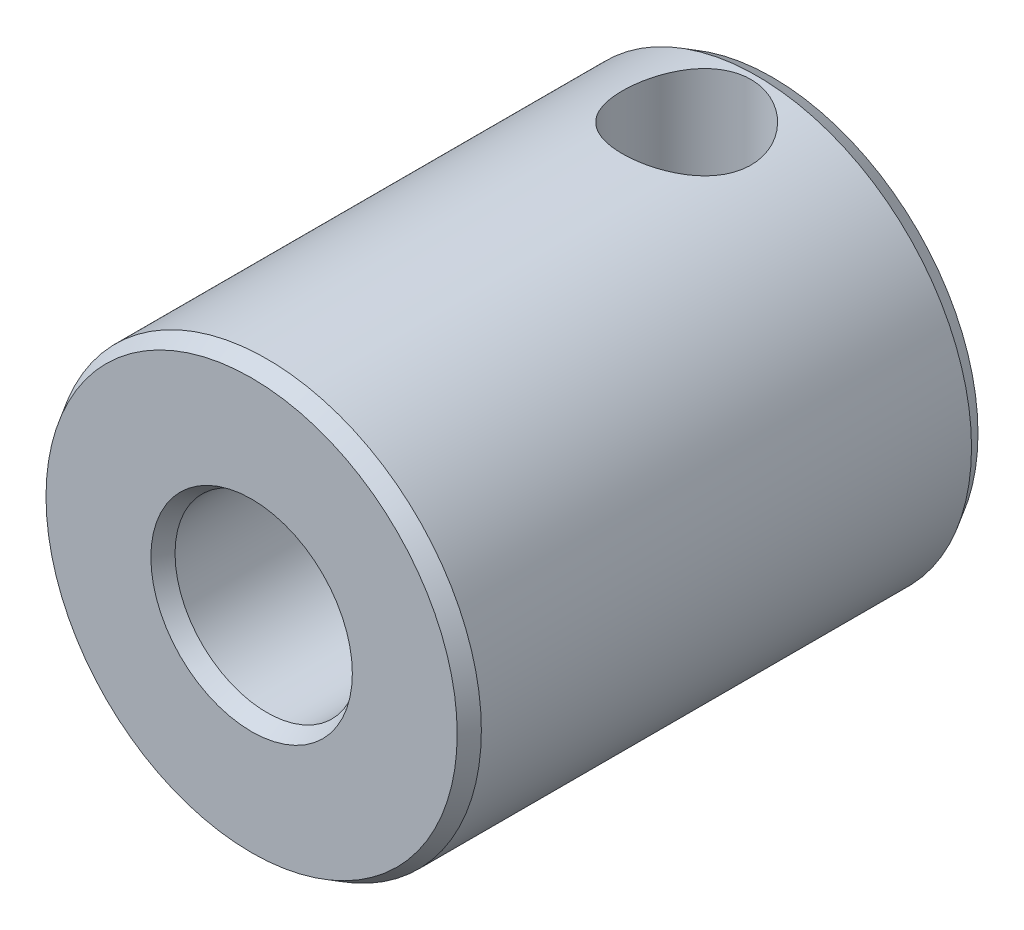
ISO-10303-21;
HEADER;
FILE_DESCRIPTION(('STEP AP214'),'2;1');
FILE_NAME('part.step','',(''),(''),'','','');
FILE_SCHEMA(('AUTOMOTIVE_DESIGN { 1 0 10303 214 1 1 1 1 }'));
ENDSEC;
DATA;
#1=APPLICATION_CONTEXT('core data for automotive mechanical design processes');
#2=APPLICATION_PROTOCOL_DEFINITION('international standard','automotive_design',2000,#1);
#3=PRODUCT_CONTEXT('',#1,'mechanical');
#4=PRODUCT('Part','Part','',(#3));
#5=PRODUCT_RELATED_PRODUCT_CATEGORY('part','',(#4));
#6=PRODUCT_DEFINITION_FORMATION('','',#4);
#7=PRODUCT_DEFINITION_CONTEXT('part definition',#1,'design');
#8=PRODUCT_DEFINITION('design','',#6,#7);
#9=PRODUCT_DEFINITION_SHAPE('','',#8);
#10=(LENGTH_UNIT() NAMED_UNIT(*) SI_UNIT(.MILLI.,.METRE.));
#11=(NAMED_UNIT(*) PLANE_ANGLE_UNIT() SI_UNIT($,.RADIAN.));
#12=(NAMED_UNIT(*) SI_UNIT($,.STERADIAN.) SOLID_ANGLE_UNIT());
#13=UNCERTAINTY_MEASURE_WITH_UNIT(LENGTH_MEASURE(1.E-05),#10,'distance_accuracy_value','');
#14=(GEOMETRIC_REPRESENTATION_CONTEXT(3) GLOBAL_UNCERTAINTY_ASSIGNED_CONTEXT((#13)) GLOBAL_UNIT_ASSIGNED_CONTEXT((#10,
#11,#12)) REPRESENTATION_CONTEXT('',''));
#15=CARTESIAN_POINT('',(0.,0.,0.));
#16=DIRECTION('',(0.,0.,1.));
#17=DIRECTION('',(1.,0.,0.));
#18=AXIS2_PLACEMENT_3D('',#15,#16,#17);
#19=CARTESIAN_POINT('',(0.,0.,20.4376167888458));
#20=DIRECTION('',(0.,0.,1.));
#21=DIRECTION('',(1.,0.,0.));
#22=AXIS2_PLACEMENT_3D('',#19,#20,#21);
#23=CYLINDRICAL_SURFACE('',#22,7.);
#24=CARTESIAN_POINT('',(0.,0.,0.5));
#25=DIRECTION('',(0.,0.,1.));
#26=DIRECTION('',(1.,0.,0.));
#27=AXIS2_PLACEMENT_3D('',#24,#25,#26);
#28=CIRCLE('',#27,7.);
#29=CARTESIAN_POINT('',(7.,0.,0.5));
#30=VERTEX_POINT('',#29);
#31=EDGE_CURVE('E25',#30,#30,#28,.T.);
#32=ORIENTED_EDGE('',*,*,#31,.T.);
#33=EDGE_LOOP('',(#32));
#34=FACE_BOUND('',#33,.T.);
#35=CARTESIAN_POINT('',(0.,0.,16.5));
#36=DIRECTION('',(0.,0.,1.));
#37=DIRECTION('',(1.,0.,0.));
#38=AXIS2_PLACEMENT_3D('',#35,#36,#37);
#39=CIRCLE('',#38,7.);
#40=CARTESIAN_POINT('',(7.,0.,16.5));
#41=VERTEX_POINT('',#40);
#42=EDGE_CURVE('E29',#41,#41,#39,.T.);
#43=ORIENTED_EDGE('',*,*,#42,.F.);
#44=EDGE_LOOP('',(#43));
#45=FACE_BOUND('',#44,.T.);
#46=CARTESIAN_POINT('',(0.,7.,4.9));
#47=CARTESIAN_POINT('',(0.11520405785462,6.9999990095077,4.89999860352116));
#48=CARTESIAN_POINT('',(0.230422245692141,6.99712881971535,4.89048859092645));
#49=CARTESIAN_POINT('',(0.457503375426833,6.98595947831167,4.85279010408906));
#50=CARTESIAN_POINT('',(0.569365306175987,6.97765870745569,4.82459605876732));
#51=CARTESIAN_POINT('',(0.786425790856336,6.95653773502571,4.75055557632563));
#52=CARTESIAN_POINT('',(0.891633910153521,6.94372420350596,4.70473518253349));
#53=CARTESIAN_POINT('',(1.09287385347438,6.91490952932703,4.59684946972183));
#54=CARTESIAN_POINT('',(1.18890445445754,6.89890796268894,4.53478198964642));
#55=CARTESIAN_POINT('',(1.37182051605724,6.86491032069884,4.39428638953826));
#56=CARTESIAN_POINT('',(1.45840529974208,6.84687337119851,4.31547672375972));
#57=CARTESIAN_POINT('',(1.61734889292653,6.81108167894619,4.14454707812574));
#58=CARTESIAN_POINT('',(1.68970530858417,6.79332698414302,4.05242486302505));
#59=CARTESIAN_POINT('',(1.81972052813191,6.75967759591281,3.85494094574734));
#60=CARTESIAN_POINT('',(1.87701232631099,6.74383369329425,3.74932815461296));
#61=CARTESIAN_POINT('',(1.97289952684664,6.71641068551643,3.52941504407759));
#62=CARTESIAN_POINT('',(2.01149941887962,6.70483055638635,3.41511681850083));
#63=CARTESIAN_POINT('',(2.06782287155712,6.68767219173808,3.18445362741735));
#64=CARTESIAN_POINT('',(2.08610074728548,6.68193497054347,3.06823615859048));
#65=CARTESIAN_POINT('',(2.10299222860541,6.67663905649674,2.83425358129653));
#66=CARTESIAN_POINT('',(2.1016105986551,6.677078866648,2.71648885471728));
#67=CARTESIAN_POINT('',(2.07965768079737,6.68394641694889,2.48726252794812));
#68=CARTESIAN_POINT('',(2.05978087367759,6.69015744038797,2.37572684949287));
#69=CARTESIAN_POINT('',(2.00252388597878,6.70751698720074,2.15765229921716));
#70=CARTESIAN_POINT('',(1.96514197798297,6.71866599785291,2.05111392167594));
#71=CARTESIAN_POINT('',(1.87342437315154,6.74481826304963,1.84435951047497));
#72=CARTESIAN_POINT('',(1.81886343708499,6.75987222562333,1.74425008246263));
#73=CARTESIAN_POINT('',(1.69449311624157,6.7921138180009,1.55437516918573));
#74=CARTESIAN_POINT('',(1.62468003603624,6.80930196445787,1.46461219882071));
#75=CARTESIAN_POINT('',(1.46833807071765,6.84475415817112,1.29403933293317));
#76=CARTESIAN_POINT('',(1.38123287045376,6.86303316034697,1.21375987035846));
#77=CARTESIAN_POINT('',(1.19456856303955,6.89797141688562,1.06882442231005));
#78=CARTESIAN_POINT('',(1.09500867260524,6.91463056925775,1.0041694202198));
#79=CARTESIAN_POINT('',(0.885297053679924,6.94460424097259,0.891996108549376));
#80=CARTESIAN_POINT('',(0.775078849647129,6.9578956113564,0.844595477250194));
#81=CARTESIAN_POINT('',(0.547743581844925,6.97946930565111,0.769160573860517));
#82=CARTESIAN_POINT('',(0.430628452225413,6.98775302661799,0.741120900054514));
#83=CARTESIAN_POINT('',(0.197333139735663,6.99815710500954,0.706086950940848));
#84=CARTESIAN_POINT('',(0.0812701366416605,7.00048790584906,0.698373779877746));
#85=CARTESIAN_POINT('',(-0.150499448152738,6.99934092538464,0.702196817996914));
#86=CARTESIAN_POINT('',(-0.266206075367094,6.9958639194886,0.713730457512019));
#87=CARTESIAN_POINT('',(-0.491265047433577,6.98362975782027,0.755138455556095));
#88=CARTESIAN_POINT('',(-0.600701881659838,6.9749936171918,0.784592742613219));
#89=CARTESIAN_POINT('',(-0.813056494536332,6.95344086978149,0.860500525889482));
#90=CARTESIAN_POINT('',(-0.91597348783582,6.94052374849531,0.906956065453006));
#91=CARTESIAN_POINT('',(-1.11501206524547,6.91137516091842,1.01675443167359));
#92=CARTESIAN_POINT('',(-1.21092135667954,6.89507393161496,1.08046307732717));
#93=CARTESIAN_POINT('',(-1.39093263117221,6.86102856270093,1.22251465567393));
#94=CARTESIAN_POINT('',(-1.47503164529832,6.84328406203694,1.30086125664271));
#95=CARTESIAN_POINT('',(-1.63220042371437,6.80754440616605,1.47334223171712));
#96=CARTESIAN_POINT('',(-1.70475873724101,6.78956355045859,1.56794662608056));
#97=CARTESIAN_POINT('',(-1.83300593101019,6.75607121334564,1.76837911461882));
#98=CARTESIAN_POINT('',(-1.88869525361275,6.74055966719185,1.87420691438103));
#99=CARTESIAN_POINT('',(-1.98124285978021,6.71394065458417,2.09374548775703));
#100=CARTESIAN_POINT('',(-2.01818885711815,6.70281272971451,2.20741666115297));
#101=CARTESIAN_POINT('',(-2.07230423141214,6.68628232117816,2.43976315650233));
#102=CARTESIAN_POINT('',(-2.08948038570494,6.68087787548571,2.55843674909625));
#103=CARTESIAN_POINT('',(-2.10310778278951,6.6765996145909,2.79210612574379));
#104=CARTESIAN_POINT('',(-2.10039277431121,6.67746306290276,2.90704911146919));
#105=CARTESIAN_POINT('',(-2.07630507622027,6.68499161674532,3.13475974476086));
#106=CARTESIAN_POINT('',(-2.05493313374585,6.69165648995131,3.24752747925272));
#107=CARTESIAN_POINT('',(-1.9946764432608,6.7098606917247,3.46632355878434));
#108=CARTESIAN_POINT('',(-1.95601245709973,6.72133846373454,3.57241820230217));
#109=CARTESIAN_POINT('',(-1.86244109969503,6.74786390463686,3.77669941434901));
#110=CARTESIAN_POINT('',(-1.80753061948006,6.76291225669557,3.8748844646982));
#111=CARTESIAN_POINT('',(-1.68068269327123,6.79556746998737,4.06442836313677));
#112=CARTESIAN_POINT('',(-1.60819786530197,6.81324756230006,4.15540826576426));
#113=CARTESIAN_POINT('',(-1.44924408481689,6.84881848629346,4.32418349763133));
#114=CARTESIAN_POINT('',(-1.36277150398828,6.8667093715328,4.40197539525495));
#115=CARTESIAN_POINT('',(-1.17525206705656,6.90131311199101,4.54443277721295));
#116=CARTESIAN_POINT('',(-1.07385304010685,6.91797623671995,4.60864802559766));
#117=CARTESIAN_POINT('',(-0.861197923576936,6.94764952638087,4.71902923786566));
#118=CARTESIAN_POINT('',(-0.749946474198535,6.9606613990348,4.76520364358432));
#119=CARTESIAN_POINT('',(-0.533060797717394,6.98043044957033,4.83405338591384));
#120=CARTESIAN_POINT('',(-0.428101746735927,6.98770838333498,4.85871634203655));
#121=CARTESIAN_POINT('',(-0.21543227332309,6.99749322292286,4.89168893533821));
#122=CARTESIAN_POINT('',(-0.107722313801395,7.00000092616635,4.90000130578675));
#123=CARTESIAN_POINT('',(0.,7.,4.9));
#124=B_SPLINE_CURVE_WITH_KNOTS('',3,(#46,#47,#48,#49,#50,#51,#52,#53,#54,#55,#56,#57,#58,#59,
#60,#61,#62,#63,#64,#65,#66,#67,#68,#69,#70,#71,#72,#73,#74,#75,#76,#77,#78,#79,#80,#81,#82,#83,
#84,#85,#86,#87,#88,#89,#90,#91,#92,#93,#94,#95,#96,#97,#98,#99,#100,#101,#102,#103,#104,#105,
#106,#107,#108,#109,#110,#111,#112,#113,#114,#115,#116,#117,#118,#119,#120,#121,#122,#123),
.UNSPECIFIED.,.T.,.F.,(4,2,2,2,2,2,2,2,2,2,2,2,2,2,2,2,2,2,2,2,2,2,2,2,2,2,2,2,2,2,2,2,2,2,2,2,
2,2,4),(0.,0.345216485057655,0.690535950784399,1.03534714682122,1.38020423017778,
1.73397844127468,2.08781212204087,2.44960073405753,2.81130240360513,3.16287565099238,
3.51436369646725,3.85316423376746,4.19199821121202,4.53547397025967,4.87903304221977,
5.23693945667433,5.594868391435,5.95519465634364,6.31542034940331,6.66272333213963,
7.00997994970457,7.34939445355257,7.6888497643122,8.03615827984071,8.38355394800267,
8.74356560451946,9.10356781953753,9.46186940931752,9.82004813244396,10.1633021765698,
10.5065424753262,10.8455205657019,11.1845635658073,11.5359569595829,11.8874416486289,
12.2492019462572,12.6107927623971,12.9336436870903,13.2564406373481),.UNSPECIFIED.);
#125=CARTESIAN_POINT('',(0.,7.,4.9));
#126=VERTEX_POINT('',#125);
#127=EDGE_CURVE('E49',#126,#126,#124,.T.);
#128=ORIENTED_EDGE('',*,*,#127,.F.);
#129=EDGE_LOOP('',(#128));
#130=FACE_BOUND('',#129,.T.);
#131=ADVANCED_FACE('F12',(#34,#45,#130),#23,.T.);
#132=CARTESIAN_POINT('',(0.,0.,20.4376167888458));
#133=DIRECTION('',(0.,0.,1.));
#134=DIRECTION('',(1.,0.,0.));
#135=AXIS2_PLACEMENT_3D('',#132,#133,#134);
#136=CYLINDRICAL_SURFACE('',#135,3.);
#137=CARTESIAN_POINT('',(0.,0.,16.5));
#138=DIRECTION('',(0.,0.,1.));
#139=DIRECTION('',(1.,0.,0.));
#140=AXIS2_PLACEMENT_3D('',#137,#138,#139);
#141=CIRCLE('',#140,3.);
#142=CARTESIAN_POINT('',(3.,0.,16.5));
#143=VERTEX_POINT('',#142);
#144=EDGE_CURVE('E40',#143,#143,#141,.T.);
#145=ORIENTED_EDGE('',*,*,#144,.T.);
#146=EDGE_LOOP('',(#145));
#147=FACE_BOUND('',#146,.T.);
#148=CARTESIAN_POINT('',(0.,0.,0.5));
#149=DIRECTION('',(0.,0.,1.));
#150=DIRECTION('',(1.,0.,0.));
#151=AXIS2_PLACEMENT_3D('',#148,#149,#150);
#152=CIRCLE('',#151,3.);
#153=CARTESIAN_POINT('',(3.,0.,0.5));
#154=VERTEX_POINT('',#153);
#155=EDGE_CURVE('E43',#154,#154,#152,.T.);
#156=ORIENTED_EDGE('',*,*,#155,.F.);
#157=EDGE_LOOP('',(#156));
#158=FACE_BOUND('',#157,.T.);
#159=CARTESIAN_POINT('',(0.,3.,4.9));
#160=CARTESIAN_POINT('',(-0.104432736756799,3.00000501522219,4.90000541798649));
#161=CARTESIAN_POINT('',(-0.208837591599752,2.99450336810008,4.89216940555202));
#162=CARTESIAN_POINT('',(-0.414280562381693,2.97305256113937,4.86135003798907));
#163=CARTESIAN_POINT('',(-0.515317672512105,2.95710030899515,4.83836219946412));
#164=CARTESIAN_POINT('',(-0.710737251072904,2.91629644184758,4.77870008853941));
#165=CARTESIAN_POINT('',(-0.80514933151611,2.8914879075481,4.74209203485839));
#166=CARTESIAN_POINT('',(-0.98603509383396,2.83491221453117,4.65681022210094));
#167=CARTESIAN_POINT('',(-1.07250761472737,2.80314404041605,4.60813470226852));
#168=CARTESIAN_POINT('',(-1.24369872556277,2.73176784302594,4.49547265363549));
#169=CARTESIAN_POINT('',(-1.32758783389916,2.69171520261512,4.4305135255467));
#170=CARTESIAN_POINT('',(-1.48403658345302,2.60873460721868,4.28954547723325));
#171=CARTESIAN_POINT('',(-1.5565789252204,2.56580240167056,4.21352001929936));
#172=CARTESIAN_POINT('',(-1.70137712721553,2.47264077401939,4.03715351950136));
#173=CARTESIAN_POINT('',(-1.77133397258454,2.42245737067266,3.93488804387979));
#174=CARTESIAN_POINT('',(-1.89310898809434,2.3285275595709,3.71739311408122));
#175=CARTESIAN_POINT('',(-1.94495749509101,2.28477045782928,3.60218577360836));
#176=CARTESIAN_POINT('',(-2.01498307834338,2.2229064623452,3.39798080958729));
#177=CARTESIAN_POINT('',(-2.03861798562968,2.20105556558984,3.31200295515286));
#178=CARTESIAN_POINT('',(-2.07488644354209,2.1669052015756,3.13598373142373));
#179=CARTESIAN_POINT('',(-2.08754153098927,2.15458704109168,3.04595068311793));
#180=CARTESIAN_POINT('',(-2.10103535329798,2.14143714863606,2.86360356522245));
#181=CARTESIAN_POINT('',(-2.10180632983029,2.14067128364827,2.77127941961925));
#182=CARTESIAN_POINT('',(-2.09128754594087,2.15094423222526,2.58796393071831));
#183=CARTESIAN_POINT('',(-2.07998949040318,2.16199116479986,2.4969735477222));
#184=CARTESIAN_POINT('',(-2.04730470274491,2.19294255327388,2.32490325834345));
#185=CARTESIAN_POINT('',(-2.02663325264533,2.21221410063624,2.24356565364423));
#186=CARTESIAN_POINT('',(-1.97646505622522,2.25714870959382,2.08552760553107));
#187=CARTESIAN_POINT('',(-1.94696123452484,2.28281689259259,2.00883093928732));
#188=CARTESIAN_POINT('',(-1.86217372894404,2.35302215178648,1.82132179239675));
#189=CARTESIAN_POINT('',(-1.80151440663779,2.40034945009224,1.7139725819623));
#190=CARTESIAN_POINT('',(-1.66330415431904,2.49812301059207,1.51220508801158));
#191=CARTESIAN_POINT('',(-1.58571887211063,2.54857546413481,1.41781374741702));
#192=CARTESIAN_POINT('',(-1.41369005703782,2.64791832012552,1.24219511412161));
#193=CARTESIAN_POINT('',(-1.3190568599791,2.69678298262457,1.16113787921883));
#194=CARTESIAN_POINT('',(-1.11475642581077,2.78742644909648,1.01591702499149));
#195=CARTESIAN_POINT('',(-1.00512108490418,2.82921987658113,0.95171838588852));
#196=CARTESIAN_POINT('',(-0.798620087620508,2.89329979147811,0.855219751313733));
#197=CARTESIAN_POINT('',(-0.704287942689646,2.91785610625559,0.819005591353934));
#198=CARTESIAN_POINT('',(-0.509635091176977,2.95806006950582,0.760249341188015));
#199=CARTESIAN_POINT('',(-0.409318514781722,2.97371378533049,0.737697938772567));
#200=CARTESIAN_POINT('',(-0.204960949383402,2.99475845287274,0.707466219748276));
#201=CARTESIAN_POINT('',(-0.100906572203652,3.00010776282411,0.699846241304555));
#202=CARTESIAN_POINT('',(0.1071692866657,2.99988896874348,0.700158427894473));
#203=CARTESIAN_POINT('',(0.211190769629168,2.99432135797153,0.70808989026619));
#204=CARTESIAN_POINT('',(0.409127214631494,2.97352984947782,0.737966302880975));
#205=CARTESIAN_POINT('',(0.503258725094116,2.95895980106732,0.758962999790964));
#206=CARTESIAN_POINT('',(0.686325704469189,2.92193204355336,0.813023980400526));
#207=CARTESIAN_POINT('',(0.775260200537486,2.89947286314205,0.846090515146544));
#208=CARTESIAN_POINT('',(0.952402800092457,2.84641444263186,0.925695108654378));
#209=CARTESIAN_POINT('',(1.04011514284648,2.81535201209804,0.973020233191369));
#210=CARTESIAN_POINT('',(1.20663723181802,2.74810948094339,1.07844432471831));
#211=CARTESIAN_POINT('',(1.28544133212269,2.71192616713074,1.13655006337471));
#212=CARTESIAN_POINT('',(1.44614034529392,2.63023261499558,1.27303625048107));
#213=CARTESIAN_POINT('',(1.52626067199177,2.58418535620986,1.35318458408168));
#214=CARTESIAN_POINT('',(1.67267885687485,2.49191411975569,1.52527432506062));
#215=CARTESIAN_POINT('',(1.73896576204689,2.44569003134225,1.61722498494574));
#216=CARTESIAN_POINT('',(1.85100448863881,2.36182108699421,1.80281351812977));
#217=CARTESIAN_POINT('',(1.89811453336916,2.32377854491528,1.89544754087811));
#218=CARTESIAN_POINT('',(1.97877743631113,2.2554908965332,2.089093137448));
#219=CARTESIAN_POINT('',(2.012356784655,2.22523059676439,2.19008787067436));
#220=CARTESIAN_POINT('',(2.0588958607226,2.18214360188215,2.37774074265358));
#221=CARTESIAN_POINT('',(2.07465263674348,2.16702854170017,2.46316614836));
#222=CARTESIAN_POINT('',(2.09543298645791,2.14694710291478,2.63644805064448));
#223=CARTESIAN_POINT('',(2.10047047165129,2.14196757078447,2.72430124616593));
#224=CARTESIAN_POINT('',(2.09945931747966,2.14295830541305,2.89998411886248));
#225=CARTESIAN_POINT('',(2.09339735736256,2.14894172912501,2.98781364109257));
#226=CARTESIAN_POINT('',(2.07061236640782,2.17089889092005,3.16084206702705));
#227=CARTESIAN_POINT('',(2.05387376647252,2.18688721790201,3.24603693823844));
#228=CARTESIAN_POINT('',(2.00457714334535,2.23227997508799,3.43542766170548));
#229=CARTESIAN_POINT('',(1.96888571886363,2.26419866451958,3.53819102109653));
#230=CARTESIAN_POINT('',(1.88351751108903,2.33569147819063,3.73482705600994));
#231=CARTESIAN_POINT('',(1.83381899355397,2.37527746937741,3.82868560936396));
#232=CARTESIAN_POINT('',(1.72043576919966,2.45869356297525,4.00900940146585));
#233=CARTESIAN_POINT('',(1.65644646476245,2.50260222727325,4.09524563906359));
#234=CARTESIAN_POINT('',(1.5160122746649,2.59008915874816,4.25711799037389));
#235=CARTESIAN_POINT('',(1.43956326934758,2.63366731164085,4.33275058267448));
#236=CARTESIAN_POINT('',(1.25960522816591,2.72494957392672,4.48514953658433));
#237=CARTESIAN_POINT('',(1.15370530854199,2.77193854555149,4.55956628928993));
#238=CARTESIAN_POINT('',(0.926928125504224,2.8557576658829,4.68885318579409));
#239=CARTESIAN_POINT('',(0.806068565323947,2.89259965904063,4.74374614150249));
#240=CARTESIAN_POINT('',(0.571963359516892,2.94704141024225,4.82380138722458));
#241=CARTESIAN_POINT('',(0.460312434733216,2.96670352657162,4.8521962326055));
#242=CARTESIAN_POINT('',(0.232425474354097,2.99317183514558,4.89028059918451));
#243=CARTESIAN_POINT('',(0.116195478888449,2.99999441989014,4.89999397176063));
#244=CARTESIAN_POINT('',(0.,3.,4.9));
#245=B_SPLINE_CURVE_WITH_KNOTS('',3,(#159,#160,#161,#162,#163,#164,#165,#166,#167,#168,#169,
#170,#171,#172,#173,#174,#175,#176,#177,#178,#179,#180,#181,#182,#183,#184,#185,#186,#187,#188,
#189,#190,#191,#192,#193,#194,#195,#196,#197,#198,#199,#200,#201,#202,#203,#204,#205,#206,#207,
#208,#209,#210,#211,#212,#213,#214,#215,#216,#217,#218,#219,#220,#221,#222,#223,#224,#225,#226,
#227,#228,#229,#230,#231,#232,#233,#234,#235,#236,#237,#238,#239,#240,#241,#242,#243,#244),
.UNSPECIFIED.,.T.,.F.,(4,2,2,2,2,2,2,2,2,2,2,2,2,2,2,2,2,2,2,2,2,2,2,2,2,2,2,2,2,2,2,2,2,2,2,2,
2,2,2,2,2,2,4),(0.,0.312830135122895,0.625752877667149,0.937173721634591,1.24864003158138,
1.58761600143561,1.9271038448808,2.32636156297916,2.72494716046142,2.99932727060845,
3.27316796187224,3.54856940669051,3.8241602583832,4.08155699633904,4.33916048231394,
4.73329686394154,5.12824073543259,5.52788543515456,5.92669327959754,6.23735439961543,
6.54780354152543,6.85950464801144,7.1711916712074,7.462538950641,7.75394059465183,
8.06594141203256,8.37813887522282,8.74370645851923,9.10956240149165,9.44040109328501,
9.77058889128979,10.033982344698,10.2970337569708,10.560401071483,10.8241533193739,
11.1624263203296,11.5012271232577,11.8480878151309,12.1950634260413,12.6058514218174,
13.0161578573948,13.3646687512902,13.7127343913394),.UNSPECIFIED.);
#246=CARTESIAN_POINT('',(0.,3.,4.9));
#247=VERTEX_POINT('',#246);
#248=EDGE_CURVE('E16',#247,#247,#245,.T.);
#249=ORIENTED_EDGE('',*,*,#248,.F.);
#250=EDGE_LOOP('',(#249));
#251=FACE_BOUND('',#250,.T.);
#252=ADVANCED_FACE('F67',(#147,#158,#251),#136,.F.);
#253=CARTESIAN_POINT('',(0.,-3.28867513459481,0.));
#254=DIRECTION('',(0.,0.,1.));
#255=DIRECTION('',(1.,0.,0.));
#256=AXIS2_PLACEMENT_3D('',#253,#254,#255);
#257=PLANE('',#256);
#258=CARTESIAN_POINT('',(0.,0.,0.));
#259=DIRECTION('',(0.,0.,1.));
#260=DIRECTION('',(1.,0.,0.));
#261=AXIS2_PLACEMENT_3D('',#258,#259,#260);
#262=CIRCLE('',#261,6.71132486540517);
#263=CARTESIAN_POINT('',(6.71132486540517,0.,0.));
#264=VERTEX_POINT('',#263);
#265=EDGE_CURVE('E8',#264,#264,#262,.T.);
#266=ORIENTED_EDGE('',*,*,#265,.F.);
#267=EDGE_LOOP('',(#266));
#268=FACE_BOUND('',#267,.T.);
#269=CARTESIAN_POINT('',(0.,0.,0.));
#270=DIRECTION('',(0.,0.,1.));
#271=DIRECTION('',(1.,0.,0.));
#272=AXIS2_PLACEMENT_3D('',#269,#270,#271);
#273=CIRCLE('',#272,3.2886751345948);
#274=CARTESIAN_POINT('',(3.2886751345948,0.,0.));
#275=VERTEX_POINT('',#274);
#276=EDGE_CURVE('E46',#275,#275,#273,.T.);
#277=ORIENTED_EDGE('',*,*,#276,.T.);
#278=EDGE_LOOP('',(#277));
#279=FACE_BOUND('',#278,.T.);
#280=ADVANCED_FACE('F14',(#268,#279),#257,.F.);
#281=CARTESIAN_POINT('',(0.,0.,0.5));
#282=DIRECTION('',(0.,0.,1.));
#283=DIRECTION('',(1.,0.,0.));
#284=AXIS2_PLACEMENT_3D('',#281,#282,#283);
#285=CONICAL_SURFACE('',#284,7.,0.523598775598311);
#286=ORIENTED_EDGE('',*,*,#265,.T.);
#287=EDGE_LOOP('',(#286));
#288=FACE_BOUND('',#287,.T.);
#289=ORIENTED_EDGE('',*,*,#31,.F.);
#290=EDGE_LOOP('',(#289));
#291=FACE_BOUND('',#290,.T.);
#292=ADVANCED_FACE('F80',(#288,#291),#285,.T.);
#293=CARTESIAN_POINT('',(0.,0.,16.5));
#294=DIRECTION('',(0.,0.,-1.));
#295=DIRECTION('',(-1.,0.,0.));
#296=AXIS2_PLACEMENT_3D('',#293,#294,#295);
#297=CONICAL_SURFACE('',#296,7.,0.523598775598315);
#298=CARTESIAN_POINT('',(0.,0.,17.));
#299=DIRECTION('',(0.,0.,1.));
#300=DIRECTION('',(1.,0.,0.));
#301=AXIS2_PLACEMENT_3D('',#298,#299,#300);
#302=CIRCLE('',#301,6.71132486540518);
#303=CARTESIAN_POINT('',(6.71132486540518,0.,17.));
#304=VERTEX_POINT('',#303);
#305=EDGE_CURVE('E34',#304,#304,#302,.T.);
#306=ORIENTED_EDGE('',*,*,#305,.F.);
#307=EDGE_LOOP('',(#306));
#308=FACE_BOUND('',#307,.T.);
#309=ORIENTED_EDGE('',*,*,#42,.T.);
#310=EDGE_LOOP('',(#309));
#311=FACE_BOUND('',#310,.T.);
#312=ADVANCED_FACE('F77',(#308,#311),#297,.T.);
#313=CARTESIAN_POINT('',(0.,-6.71132486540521,17.));
#314=DIRECTION('',(0.,0.,-1.));
#315=DIRECTION('',(-1.,0.,0.));
#316=AXIS2_PLACEMENT_3D('',#313,#314,#315);
#317=PLANE('',#316);
#318=CARTESIAN_POINT('',(0.,0.,17.));
#319=DIRECTION('',(0.,0.,1.));
#320=DIRECTION('',(1.,0.,0.));
#321=AXIS2_PLACEMENT_3D('',#318,#319,#320);
#322=CIRCLE('',#321,3.2886751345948);
#323=CARTESIAN_POINT('',(3.2886751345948,0.,17.));
#324=VERTEX_POINT('',#323);
#325=EDGE_CURVE('E37',#324,#324,#322,.T.);
#326=ORIENTED_EDGE('',*,*,#325,.F.);
#327=EDGE_LOOP('',(#326));
#328=FACE_BOUND('',#327,.T.);
#329=ORIENTED_EDGE('',*,*,#305,.T.);
#330=EDGE_LOOP('',(#329));
#331=FACE_BOUND('',#330,.T.);
#332=ADVANCED_FACE('F74',(#328,#331),#317,.F.);
#333=CARTESIAN_POINT('',(0.,0.,17.));
#334=DIRECTION('',(0.,0.,1.));
#335=DIRECTION('',(1.,0.,0.));
#336=AXIS2_PLACEMENT_3D('',#333,#334,#335);
#337=CONICAL_SURFACE('',#336,3.2886751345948,0.523598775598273);
#338=ORIENTED_EDGE('',*,*,#144,.F.);
#339=EDGE_LOOP('',(#338));
#340=FACE_BOUND('',#339,.T.);
#341=ORIENTED_EDGE('',*,*,#325,.T.);
#342=EDGE_LOOP('',(#341));
#343=FACE_BOUND('',#342,.T.);
#344=ADVANCED_FACE('F65',(#340,#343),#337,.F.);
#345=CARTESIAN_POINT('',(0.,0.,0.));
#346=DIRECTION('',(0.,0.,-1.));
#347=DIRECTION('',(-1.,0.,0.));
#348=AXIS2_PLACEMENT_3D('',#345,#346,#347);
#349=CONICAL_SURFACE('',#348,3.2886751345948,0.523598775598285);
#350=ORIENTED_EDGE('',*,*,#155,.T.);
#351=EDGE_LOOP('',(#350));
#352=FACE_BOUND('',#351,.T.);
#353=ORIENTED_EDGE('',*,*,#276,.F.);
#354=EDGE_LOOP('',(#353));
#355=FACE_BOUND('',#354,.T.);
#356=ADVANCED_FACE('F61',(#352,#355),#349,.F.);
#357=CARTESIAN_POINT('',(0.,7.,2.8));
#358=DIRECTION('',(0.,-1.,0.));
#359=DIRECTION('',(0.,0.,1.));
#360=AXIS2_PLACEMENT_3D('',#357,#358,#359);
#361=CYLINDRICAL_SURFACE('',#360,2.1);
#362=ORIENTED_EDGE('',*,*,#248,.T.);
#363=EDGE_LOOP('',(#362));
#364=FACE_BOUND('',#363,.T.);
#365=ORIENTED_EDGE('',*,*,#127,.T.);
#366=EDGE_LOOP('',(#365));
#367=FACE_BOUND('',#366,.T.);
#368=ADVANCED_FACE('F57',(#364,#367),#361,.F.);
#369=CLOSED_SHELL('',(#131,#252,#280,#292,#312,#332,#344,#356,#368));
#370=MANIFOLD_SOLID_BREP('B1',#369);
#371=ADVANCED_BREP_SHAPE_REPRESENTATION('',(#18,#370),#14);
#372=SHAPE_DEFINITION_REPRESENTATION(#9,#371);
ENDSEC;
END-ISO-10303-21;
